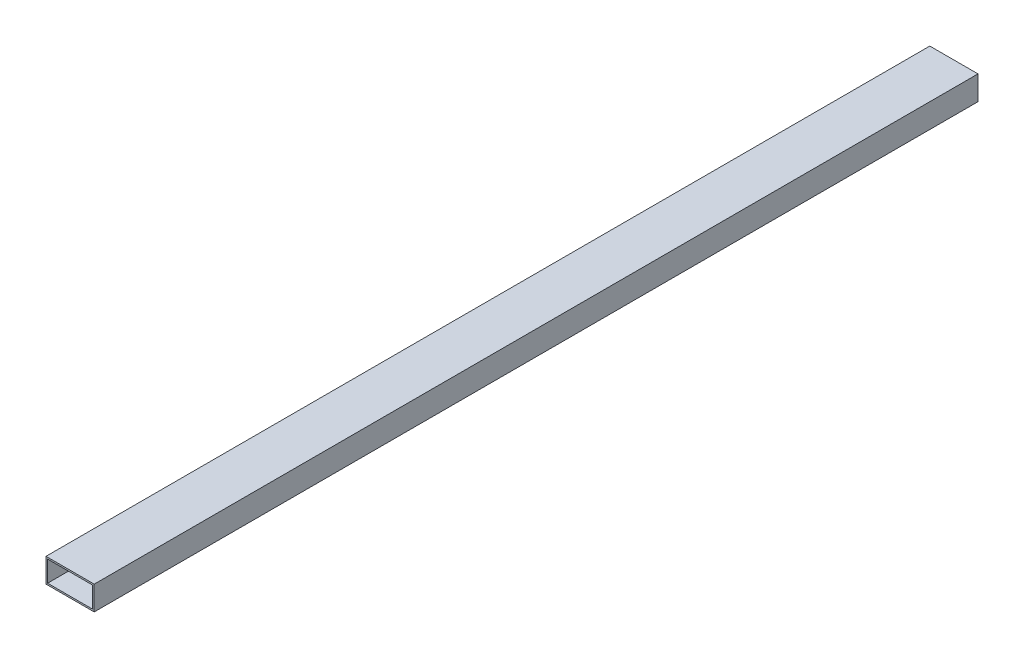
ISO-10303-21;
HEADER;
FILE_DESCRIPTION(('STEP AP214'),'2;1');
FILE_NAME('part.step','',(''),(''),'','','');
FILE_SCHEMA(('AUTOMOTIVE_DESIGN { 1 0 10303 214 1 1 1 1 }'));
ENDSEC;
DATA;
#1=APPLICATION_CONTEXT('core data for automotive mechanical design processes');
#2=APPLICATION_PROTOCOL_DEFINITION('international standard','automotive_design',2000,#1);
#3=PRODUCT_CONTEXT('',#1,'mechanical');
#4=PRODUCT('Part','Part','',(#3));
#5=PRODUCT_RELATED_PRODUCT_CATEGORY('part','',(#4));
#6=PRODUCT_DEFINITION_FORMATION('','',#4);
#7=PRODUCT_DEFINITION_CONTEXT('part definition',#1,'design');
#8=PRODUCT_DEFINITION('design','',#6,#7);
#9=PRODUCT_DEFINITION_SHAPE('','',#8);
#10=(LENGTH_UNIT() NAMED_UNIT(*) SI_UNIT(.MILLI.,.METRE.));
#11=(NAMED_UNIT(*) PLANE_ANGLE_UNIT() SI_UNIT($,.RADIAN.));
#12=(NAMED_UNIT(*) SI_UNIT($,.STERADIAN.) SOLID_ANGLE_UNIT());
#13=UNCERTAINTY_MEASURE_WITH_UNIT(LENGTH_MEASURE(1.E-05),#10,'distance_accuracy_value','');
#14=(GEOMETRIC_REPRESENTATION_CONTEXT(3) GLOBAL_UNCERTAINTY_ASSIGNED_CONTEXT((#13)) GLOBAL_UNIT_ASSIGNED_CONTEXT((#10,
#11,#12)) REPRESENTATION_CONTEXT('',''));
#15=CARTESIAN_POINT('',(0.,0.,0.));
#16=DIRECTION('',(0.,0.,1.));
#17=DIRECTION('',(1.,0.,0.));
#18=AXIS2_PLACEMENT_3D('',#15,#16,#17);
#19=CARTESIAN_POINT('',(-30.,-15.,1100.));
#20=DIRECTION('',(0.,0.,1.));
#21=DIRECTION('',(1.,0.,0.));
#22=AXIS2_PLACEMENT_3D('',#19,#20,#21);
#23=PLANE('',#22);
#24=DIRECTION('',(0.,-1.,0.));
#25=VECTOR('',#24,1.);
#26=CARTESIAN_POINT('',(-30.,15.,1100.));
#27=LINE('',#26,#25);
#28=CARTESIAN_POINT('',(-30.,15.,1100.));
#29=VERTEX_POINT('',#28);
#30=CARTESIAN_POINT('',(-30.,-15.,1100.));
#31=VERTEX_POINT('',#30);
#32=EDGE_CURVE('E157',#29,#31,#27,.T.);
#33=ORIENTED_EDGE('',*,*,#32,.T.);
#34=DIRECTION('',(1.,0.,0.));
#35=VECTOR('',#34,1.);
#36=CARTESIAN_POINT('',(-30.,-15.,1100.));
#37=LINE('',#36,#35);
#38=CARTESIAN_POINT('',(30.,-15.,1100.));
#39=VERTEX_POINT('',#38);
#40=EDGE_CURVE('E160',#31,#39,#37,.T.);
#41=ORIENTED_EDGE('',*,*,#40,.T.);
#42=DIRECTION('',(0.,1.,0.));
#43=VECTOR('',#42,1.);
#44=CARTESIAN_POINT('',(30.,15.,1100.));
#45=LINE('',#44,#43);
#46=CARTESIAN_POINT('',(30.,15.,1100.));
#47=VERTEX_POINT('',#46);
#48=EDGE_CURVE('E163',#39,#47,#45,.T.);
#49=ORIENTED_EDGE('',*,*,#48,.T.);
#50=DIRECTION('',(-1.,0.,0.));
#51=VECTOR('',#50,1.);
#52=CARTESIAN_POINT('',(-30.,15.,1100.));
#53=LINE('',#52,#51);
#54=EDGE_CURVE('E165',#47,#29,#53,.T.);
#55=ORIENTED_EDGE('',*,*,#54,.T.);
#56=EDGE_LOOP('',(#33,#41,#49,#55));
#57=FACE_BOUND('',#56,.T.);
#58=DIRECTION('',(1.,0.,0.));
#59=VECTOR('',#58,1.);
#60=CARTESIAN_POINT('',(-30.,-13.,1100.));
#61=LINE('',#60,#59);
#62=CARTESIAN_POINT('',(-28.,-13.,1100.));
#63=VERTEX_POINT('',#62);
#64=CARTESIAN_POINT('',(28.,-13.,1100.));
#65=VERTEX_POINT('',#64);
#66=EDGE_CURVE('E128',#63,#65,#61,.T.);
#67=ORIENTED_EDGE('',*,*,#66,.F.);
#68=DIRECTION('',(0.,-1.,0.));
#69=VECTOR('',#68,1.);
#70=CARTESIAN_POINT('',(-28.,15.,1100.));
#71=LINE('',#70,#69);
#72=CARTESIAN_POINT('',(-28.,13.,1100.));
#73=VERTEX_POINT('',#72);
#74=EDGE_CURVE('E120',#73,#63,#71,.T.);
#75=ORIENTED_EDGE('',*,*,#74,.F.);
#76=DIRECTION('',(-1.,0.,0.));
#77=VECTOR('',#76,1.);
#78=CARTESIAN_POINT('',(-30.,13.,1100.));
#79=LINE('',#78,#77);
#80=CARTESIAN_POINT('',(28.,13.,1100.));
#81=VERTEX_POINT('',#80);
#82=EDGE_CURVE('E142',#81,#73,#79,.T.);
#83=ORIENTED_EDGE('',*,*,#82,.F.);
#84=DIRECTION('',(0.,1.,0.));
#85=VECTOR('',#84,1.);
#86=CARTESIAN_POINT('',(28.,15.,1100.));
#87=LINE('',#86,#85);
#88=EDGE_CURVE('E140',#65,#81,#87,.T.);
#89=ORIENTED_EDGE('',*,*,#88,.F.);
#90=EDGE_LOOP('',(#67,#75,#83,#89));
#91=FACE_BOUND('',#90,.T.);
#92=ADVANCED_FACE('F54',(#57,#91),#23,.T.);
#93=CARTESIAN_POINT('',(-30.,-15.,0.));
#94=DIRECTION('',(0.,0.,1.));
#95=DIRECTION('',(1.,0.,0.));
#96=AXIS2_PLACEMENT_3D('',#93,#94,#95);
#97=PLANE('',#96);
#98=DIRECTION('',(0.,-1.,0.));
#99=VECTOR('',#98,1.);
#100=CARTESIAN_POINT('',(-30.,15.,0.));
#101=LINE('',#100,#99);
#102=CARTESIAN_POINT('',(-30.,15.,0.));
#103=VERTEX_POINT('',#102);
#104=CARTESIAN_POINT('',(-30.,-15.,0.));
#105=VERTEX_POINT('',#104);
#106=EDGE_CURVE('E136',#103,#105,#101,.T.);
#107=ORIENTED_EDGE('',*,*,#106,.F.);
#108=DIRECTION('',(-1.,0.,0.));
#109=VECTOR('',#108,1.);
#110=CARTESIAN_POINT('',(-30.,15.,0.));
#111=LINE('',#110,#109);
#112=CARTESIAN_POINT('',(30.,15.,0.));
#113=VERTEX_POINT('',#112);
#114=EDGE_CURVE('E161',#113,#103,#111,.T.);
#115=ORIENTED_EDGE('',*,*,#114,.F.);
#116=DIRECTION('',(0.,1.,0.));
#117=VECTOR('',#116,1.);
#118=CARTESIAN_POINT('',(30.,15.,0.));
#119=LINE('',#118,#117);
#120=CARTESIAN_POINT('',(30.,-15.,0.));
#121=VERTEX_POINT('',#120);
#122=EDGE_CURVE('E172',#121,#113,#119,.T.);
#123=ORIENTED_EDGE('',*,*,#122,.F.);
#124=DIRECTION('',(1.,0.,0.));
#125=VECTOR('',#124,1.);
#126=CARTESIAN_POINT('',(-30.,-15.,0.));
#127=LINE('',#126,#125);
#128=EDGE_CURVE('E170',#105,#121,#127,.T.);
#129=ORIENTED_EDGE('',*,*,#128,.F.);
#130=EDGE_LOOP('',(#107,#115,#123,#129));
#131=FACE_BOUND('',#130,.T.);
#132=DIRECTION('',(0.,-1.,0.));
#133=VECTOR('',#132,1.);
#134=CARTESIAN_POINT('',(-28.,15.,0.));
#135=LINE('',#134,#133);
#136=CARTESIAN_POINT('',(-28.,13.,0.));
#137=VERTEX_POINT('',#136);
#138=CARTESIAN_POINT('',(-28.,-13.,0.));
#139=VERTEX_POINT('',#138);
#140=EDGE_CURVE('E78',#137,#139,#135,.T.);
#141=ORIENTED_EDGE('',*,*,#140,.T.);
#142=DIRECTION('',(1.,0.,0.));
#143=VECTOR('',#142,1.);
#144=CARTESIAN_POINT('',(-30.,-13.,0.));
#145=LINE('',#144,#143);
#146=CARTESIAN_POINT('',(28.,-13.,0.));
#147=VERTEX_POINT('',#146);
#148=EDGE_CURVE('E135',#139,#147,#145,.T.);
#149=ORIENTED_EDGE('',*,*,#148,.T.);
#150=DIRECTION('',(0.,1.,0.));
#151=VECTOR('',#150,1.);
#152=CARTESIAN_POINT('',(28.,15.,0.));
#153=LINE('',#152,#151);
#154=CARTESIAN_POINT('',(28.,13.,0.));
#155=VERTEX_POINT('',#154);
#156=EDGE_CURVE('E149',#147,#155,#153,.T.);
#157=ORIENTED_EDGE('',*,*,#156,.T.);
#158=DIRECTION('',(-1.,0.,0.));
#159=VECTOR('',#158,1.);
#160=CARTESIAN_POINT('',(-30.,13.,0.));
#161=LINE('',#160,#159);
#162=EDGE_CURVE('E129',#155,#137,#161,.T.);
#163=ORIENTED_EDGE('',*,*,#162,.T.);
#164=EDGE_LOOP('',(#141,#149,#157,#163));
#165=FACE_BOUND('',#164,.T.);
#166=ADVANCED_FACE('F191',(#131,#165),#97,.F.);
#167=CARTESIAN_POINT('',(-30.,15.,1100.));
#168=DIRECTION('',(1.,0.,0.));
#169=DIRECTION('',(0.,1.,0.));
#170=AXIS2_PLACEMENT_3D('',#167,#168,#169);
#171=PLANE('',#170);
#172=ORIENTED_EDGE('',*,*,#106,.T.);
#173=DIRECTION('',(0.,0.,-1.));
#174=VECTOR('',#173,1.);
#175=CARTESIAN_POINT('',(-30.,-15.,1100.));
#176=LINE('',#175,#174);
#177=EDGE_CURVE('E12',#31,#105,#176,.T.);
#178=ORIENTED_EDGE('',*,*,#177,.F.);
#179=ORIENTED_EDGE('',*,*,#32,.F.);
#180=DIRECTION('',(0.,0.,-1.));
#181=VECTOR('',#180,1.);
#182=CARTESIAN_POINT('',(-30.,15.,1100.));
#183=LINE('',#182,#181);
#184=EDGE_CURVE('E167',#29,#103,#183,.T.);
#185=ORIENTED_EDGE('',*,*,#184,.T.);
#186=EDGE_LOOP('',(#172,#178,#179,#185));
#187=FACE_BOUND('',#186,.T.);
#188=ADVANCED_FACE('F56',(#187),#171,.F.);
#189=CARTESIAN_POINT('',(-30.,-15.,1100.));
#190=DIRECTION('',(0.,1.,0.));
#191=DIRECTION('',(-1.,0.,0.));
#192=AXIS2_PLACEMENT_3D('',#189,#190,#191);
#193=PLANE('',#192);
#194=CARTESIAN_POINT('',(0.,-15.,50.));
#195=DIRECTION('',(0.,-1.,0.));
#196=DIRECTION('',(1.,0.,0.));
#197=AXIS2_PLACEMENT_3D('',#194,#195,#196);
#198=CIRCLE('',#197,12.5);
#199=CARTESIAN_POINT('',(12.5,-15.,50.));
#200=VERTEX_POINT('',#199);
#201=EDGE_CURVE('E246',#200,#200,#198,.T.);
#202=ORIENTED_EDGE('',*,*,#201,.F.);
#203=EDGE_LOOP('',(#202));
#204=FACE_BOUND('',#203,.T.);
#205=ORIENTED_EDGE('',*,*,#128,.T.);
#206=DIRECTION('',(0.,0.,-1.));
#207=VECTOR('',#206,1.);
#208=CARTESIAN_POINT('',(30.,-15.,1100.));
#209=LINE('',#208,#207);
#210=EDGE_CURVE('E63',#39,#121,#209,.T.);
#211=ORIENTED_EDGE('',*,*,#210,.F.);
#212=ORIENTED_EDGE('',*,*,#40,.F.);
#213=ORIENTED_EDGE('',*,*,#177,.T.);
#214=EDGE_LOOP('',(#205,#211,#212,#213));
#215=FACE_BOUND('',#214,.T.);
#216=ADVANCED_FACE('F201',(#204,#215),#193,.F.);
#217=CARTESIAN_POINT('',(30.,15.,1100.));
#218=DIRECTION('',(-1.,0.,0.));
#219=DIRECTION('',(0.,0.,1.));
#220=AXIS2_PLACEMENT_3D('',#217,#218,#219);
#221=PLANE('',#220);
#222=ORIENTED_EDGE('',*,*,#122,.T.);
#223=DIRECTION('',(0.,0.,-1.));
#224=VECTOR('',#223,1.);
#225=CARTESIAN_POINT('',(30.,15.,1100.));
#226=LINE('',#225,#224);
#227=EDGE_CURVE('E177',#47,#113,#226,.T.);
#228=ORIENTED_EDGE('',*,*,#227,.F.);
#229=ORIENTED_EDGE('',*,*,#48,.F.);
#230=ORIENTED_EDGE('',*,*,#210,.T.);
#231=EDGE_LOOP('',(#222,#228,#229,#230));
#232=FACE_BOUND('',#231,.T.);
#233=ADVANCED_FACE('F185',(#232),#221,.F.);
#234=CARTESIAN_POINT('',(-30.,15.,1100.));
#235=DIRECTION('',(0.,-1.,0.));
#236=DIRECTION('',(1.,0.,0.));
#237=AXIS2_PLACEMENT_3D('',#234,#235,#236);
#238=PLANE('',#237);
#239=ORIENTED_EDGE('',*,*,#114,.T.);
#240=ORIENTED_EDGE('',*,*,#184,.F.);
#241=ORIENTED_EDGE('',*,*,#54,.F.);
#242=ORIENTED_EDGE('',*,*,#227,.T.);
#243=EDGE_LOOP('',(#239,#240,#241,#242));
#244=FACE_BOUND('',#243,.T.);
#245=ADVANCED_FACE('F195',(#244),#238,.F.);
#246=CARTESIAN_POINT('',(-28.,15.,1100.));
#247=DIRECTION('',(1.,0.,0.));
#248=DIRECTION('',(0.,1.,0.));
#249=AXIS2_PLACEMENT_3D('',#246,#247,#248);
#250=PLANE('',#249);
#251=ORIENTED_EDGE('',*,*,#140,.F.);
#252=DIRECTION('',(0.,0.,-1.));
#253=VECTOR('',#252,1.);
#254=CARTESIAN_POINT('',(-28.,13.,1100.));
#255=LINE('',#254,#253);
#256=EDGE_CURVE('E124',#73,#137,#255,.T.);
#257=ORIENTED_EDGE('',*,*,#256,.F.);
#258=ORIENTED_EDGE('',*,*,#74,.T.);
#259=DIRECTION('',(0.,0.,-1.));
#260=VECTOR('',#259,1.);
#261=CARTESIAN_POINT('',(-28.,-13.,1100.));
#262=LINE('',#261,#260);
#263=EDGE_CURVE('E123',#63,#139,#262,.T.);
#264=ORIENTED_EDGE('',*,*,#263,.T.);
#265=EDGE_LOOP('',(#251,#257,#258,#264));
#266=FACE_BOUND('',#265,.T.);
#267=ADVANCED_FACE('F122',(#266),#250,.T.);
#268=CARTESIAN_POINT('',(-30.,-13.,1100.));
#269=DIRECTION('',(0.,1.,0.));
#270=DIRECTION('',(-1.,0.,0.));
#271=AXIS2_PLACEMENT_3D('',#268,#269,#270);
#272=PLANE('',#271);
#273=CARTESIAN_POINT('',(0.,-13.,50.));
#274=DIRECTION('',(0.,1.,0.));
#275=DIRECTION('',(-1.,0.,0.));
#276=AXIS2_PLACEMENT_3D('',#273,#274,#275);
#277=CIRCLE('',#276,12.5);
#278=CARTESIAN_POINT('',(-12.5,-13.,50.));
#279=VERTEX_POINT('',#278);
#280=EDGE_CURVE('E58',#279,#279,#277,.T.);
#281=ORIENTED_EDGE('',*,*,#280,.F.);
#282=EDGE_LOOP('',(#281));
#283=FACE_BOUND('',#282,.T.);
#284=ORIENTED_EDGE('',*,*,#148,.F.);
#285=ORIENTED_EDGE('',*,*,#263,.F.);
#286=ORIENTED_EDGE('',*,*,#66,.T.);
#287=DIRECTION('',(0.,0.,-1.));
#288=VECTOR('',#287,1.);
#289=CARTESIAN_POINT('',(28.,-13.,1100.));
#290=LINE('',#289,#288);
#291=EDGE_CURVE('E137',#65,#147,#290,.T.);
#292=ORIENTED_EDGE('',*,*,#291,.T.);
#293=EDGE_LOOP('',(#284,#285,#286,#292));
#294=FACE_BOUND('',#293,.T.);
#295=ADVANCED_FACE('F132',(#283,#294),#272,.T.);
#296=CARTESIAN_POINT('',(28.,15.,1100.));
#297=DIRECTION('',(-1.,0.,0.));
#298=DIRECTION('',(0.,0.,1.));
#299=AXIS2_PLACEMENT_3D('',#296,#297,#298);
#300=PLANE('',#299);
#301=ORIENTED_EDGE('',*,*,#156,.F.);
#302=ORIENTED_EDGE('',*,*,#291,.F.);
#303=ORIENTED_EDGE('',*,*,#88,.T.);
#304=DIRECTION('',(0.,0.,-1.));
#305=VECTOR('',#304,1.);
#306=CARTESIAN_POINT('',(28.,13.,1100.));
#307=LINE('',#306,#305);
#308=EDGE_CURVE('E70',#81,#155,#307,.T.);
#309=ORIENTED_EDGE('',*,*,#308,.T.);
#310=EDGE_LOOP('',(#301,#302,#303,#309));
#311=FACE_BOUND('',#310,.T.);
#312=ADVANCED_FACE('F226',(#311),#300,.T.);
#313=CARTESIAN_POINT('',(-30.,13.,1100.));
#314=DIRECTION('',(0.,-1.,0.));
#315=DIRECTION('',(1.,0.,0.));
#316=AXIS2_PLACEMENT_3D('',#313,#314,#315);
#317=PLANE('',#316);
#318=ORIENTED_EDGE('',*,*,#162,.F.);
#319=ORIENTED_EDGE('',*,*,#308,.F.);
#320=ORIENTED_EDGE('',*,*,#82,.T.);
#321=ORIENTED_EDGE('',*,*,#256,.T.);
#322=EDGE_LOOP('',(#318,#319,#320,#321));
#323=FACE_BOUND('',#322,.T.);
#324=ADVANCED_FACE('F231',(#323),#317,.T.);
#325=CARTESIAN_POINT('',(0.,-4.99999999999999,50.));
#326=DIRECTION('',(0.,-1.,0.));
#327=DIRECTION('',(1.,0.,0.));
#328=AXIS2_PLACEMENT_3D('',#325,#326,#327);
#329=CYLINDRICAL_SURFACE('',#328,12.5);
#330=ORIENTED_EDGE('',*,*,#280,.T.);
#331=EDGE_LOOP('',(#330));
#332=FACE_BOUND('',#331,.T.);
#333=ORIENTED_EDGE('',*,*,#201,.T.);
#334=EDGE_LOOP('',(#333));
#335=FACE_BOUND('',#334,.T.);
#336=ADVANCED_FACE('F238',(#332,#335),#329,.F.);
#337=CLOSED_SHELL('',(#92,#166,#188,#216,#233,#245,#267,#295,#312,#324,#336));
#338=MANIFOLD_SOLID_BREP('B2',#337);
#339=ADVANCED_BREP_SHAPE_REPRESENTATION('',(#18,#338),#14);
#340=SHAPE_DEFINITION_REPRESENTATION(#9,#339);
ENDSEC;
END-ISO-10303-21;
